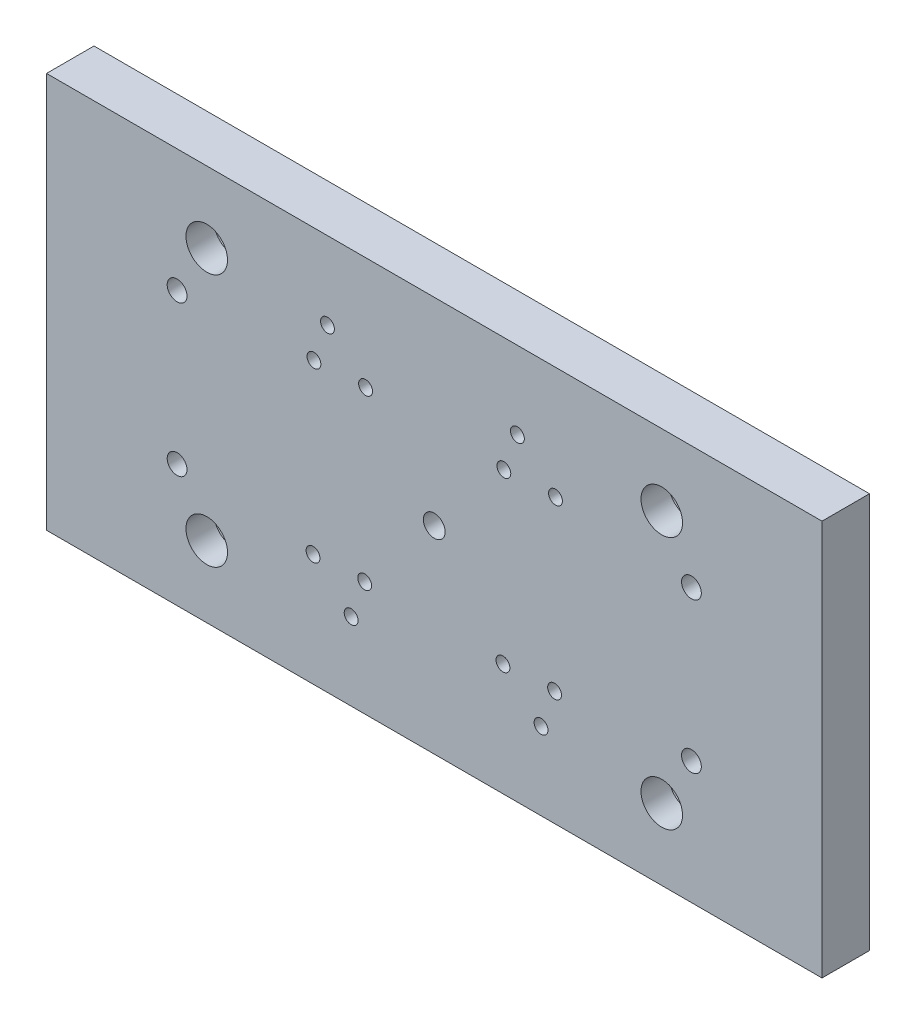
from build123d import *

# Parameters (mm, degrees)
ESQUISSE1_W             = 196
ESQUISSE1_H             = 100
EXTRUSION1_DEPTH        = 12
ESQUISSE2_R             = 5.25
ESQUISSE2_R_2           = 2.75
ENL_V_MAT_EXTRU_1_DEPTH = 221.363336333
ESQUISSE3_R             = 1.75
ENL_V_MAT_EXTRU_2_DEPTH = 221.363336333
ESQUISSE4_R             = 5.5
ENL_V_MAT_EXTRU_3_DEPTH = 3.05
ESQUISSE5_R             = 3.5
ENL_V_MAT_EXTRU_4_DEPTH = 3.05
ESQUISSE6_R             = 8.5
ENL_V_MAT_EXTRU_5_DEPTH = 5
TROU_TARAUD_M6X1_01_D   = 5


with BuildPart() as part:
    # Esquisse1 → Extrusion1 (new body)
    with BuildSketch(Plane.XY):
        with Locations((98, 50)):
            Rectangle(ESQUISSE1_W, ESQUISSE1_H)
    extrude(amount=EXTRUSION1_DEPTH)

    # Esquisse2 → Enl_v. mat.-Extru.1 (cut, through all)
    with BuildSketch(Plane.XY.offset(12)):
        with Locations((155.5, 82)):
            Circle(ESQUISSE2_R)
        with Locations(Location((40.5, 82, 0), (0, 0, 180))):
            Circle(ESQUISSE2_R)
        with Locations((40.5, 18)):
            Circle(ESQUISSE2_R)
        with Locations(Location((155.5, 18, 0), (0, 0, 180))):
            Circle(ESQUISSE2_R)
        with Locations((98, 50)):
            Circle(ESQUISSE2_R_2)
    extrude(amount=-ENL_V_MAT_EXTRU_1_DEPTH, mode=Mode.SUBTRACT)

    # Esquisse3 → Enl_v. mat.-Extru.2 (cut, through all)
    with BuildSketch(Plane.XY.offset(12)):
        with Locations((119.01, 80.41)):
            Circle(ESQUISSE3_R)
        with Locations((128.64, 71.58)):
            Circle(ESQUISSE3_R)
        with Locations((115.59, 71.07)):
            Circle(ESQUISSE3_R)
        with Locations((80.64, 71.58)):
            Circle(ESQUISSE3_R)
        with Locations((71.01, 80.41)):
            Circle(ESQUISSE3_R)
        with Locations((67.59, 71.01)):
            Circle(ESQUISSE3_R)
        with Locations((76.99, 19.59)):
            Circle(ESQUISSE3_R)
        with Locations((67.36, 28.42)):
            Circle(ESQUISSE3_R)
        with Locations((80.41, 28.93)):
            Circle(ESQUISSE3_R)
        with Locations((124.99, 19.59)):
            Circle(ESQUISSE3_R)
        with Locations((128.41, 28.99)):
            Circle(ESQUISSE3_R)
        with Locations((115.36, 28.42)):
            Circle(ESQUISSE3_R)
    extrude(amount=-ENL_V_MAT_EXTRU_2_DEPTH, mode=Mode.SUBTRACT)

    # Esquisse4 → Enl_v. mat.-Extru.3 (cut)
    with BuildSketch(Plane(origin=(0, 0, 0), x_dir=(-1, 0, 0), z_dir=(0, 0, -1))):
        with Locations((-98, 50)):
            Circle(ESQUISSE4_R)
    extrude(amount=-ENL_V_MAT_EXTRU_3_DEPTH, mode=Mode.SUBTRACT)

    # Esquisse5 → Enl_v. mat.-Extru.4 (cut)
    with BuildSketch(Plane(origin=(0, 0, 0), x_dir=(-1, 0, 0), z_dir=(0, 0, -1))):
        with Locations((-124.99, 19.59)):
            Circle(ESQUISSE5_R)
        with Locations((-128.41, 28.99)):
            Circle(ESQUISSE5_R)
        with Locations((-115.36, 28.42)):
            Circle(ESQUISSE5_R)
        with Locations((-80.41, 28.93)):
            Circle(ESQUISSE5_R)
        with Locations((-76.99, 19.59)):
            Circle(ESQUISSE5_R)
        with Locations((-67.36, 28.42)):
            Circle(ESQUISSE5_R)
        with Locations((-67.59, 71.01)):
            Circle(ESQUISSE5_R)
        with Locations((-71.01, 80.41)):
            Circle(ESQUISSE5_R)
        with Locations((-80.64, 71.58)):
            Circle(ESQUISSE5_R)
        with Locations((-128.64, 71.58)):
            Circle(ESQUISSE5_R)
        with Locations((-119.01, 80.41)):
            Circle(ESQUISSE5_R)
        with Locations((-115.59, 71.07)):
            Circle(ESQUISSE5_R)
    extrude(amount=-ENL_V_MAT_EXTRU_4_DEPTH, mode=Mode.SUBTRACT)

    # Esquisse6 → Enl_v. mat.-Extru.5 (cut)
    with BuildSketch(Plane(origin=(0, 0, 0), x_dir=(-1, 0, 0), z_dir=(0, 0, -1))):
        with Locations((-155.5, 82)):
            Circle(ESQUISSE6_R)
        with Locations(Location((-40.5, 82, 0), (0, 0, 180))):
            Circle(ESQUISSE6_R)
        with Locations((-40.5, 18)):
            Circle(ESQUISSE6_R)
        with Locations(Location((-155.5, 18, 0), (0, 0, 180))):
            Circle(ESQUISSE6_R)
    extrude(amount=-ENL_V_MAT_EXTRU_5_DEPTH, mode=Mode.SUBTRACT)

    # Trou taraud_ M6x1.01 (through all)
    with Locations(Plane(origin=(0, 0, 0), x_dir=(-1, 0, 0), z_dir=(0, 0, -1))):
        with Locations((-33, 69), (-163, 69), (-163, 31), (-33, 31)):
            Hole(TROU_TARAUD_M6X1_01_D / 2)


solid = part.part
